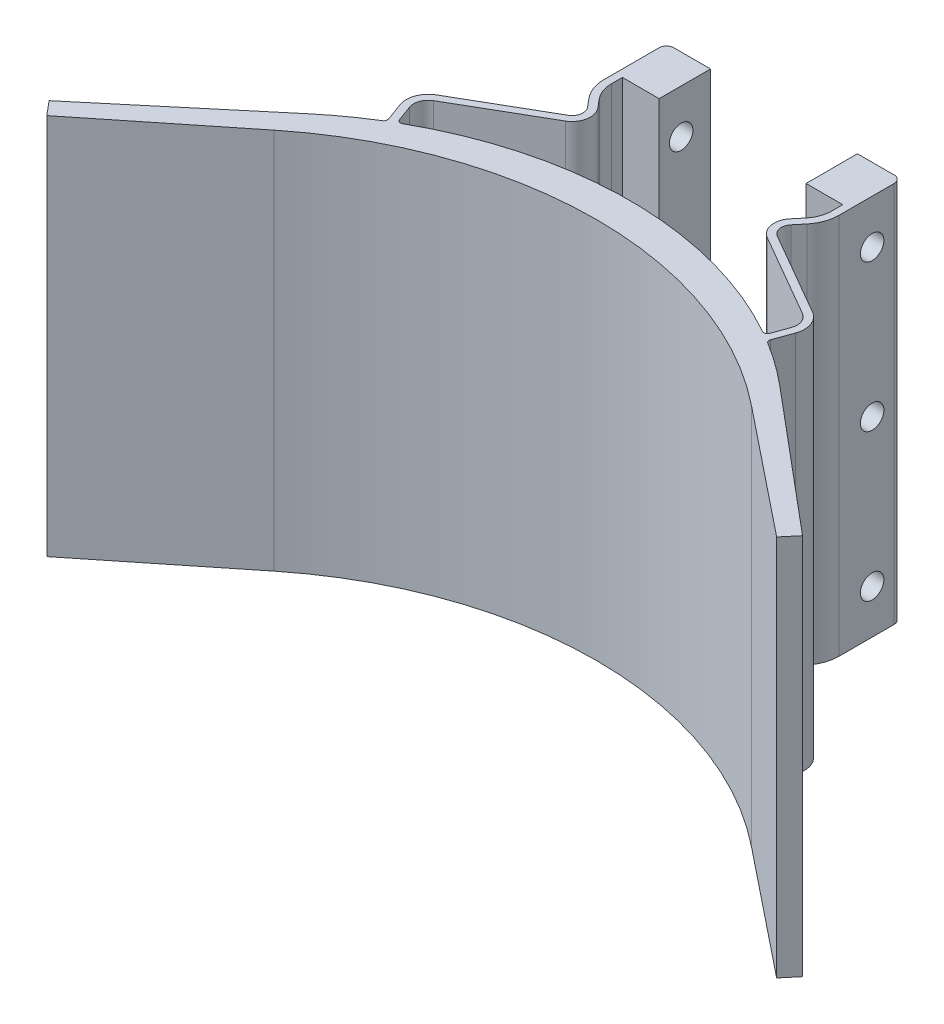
from build123d import *

# Parameters (mm, degrees)
EXTRUDE_1_DEPTH     = 52
SKETCH_2_R          = 1.6
CUT_EXTRUDE_1_DEPTH = 98.011718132
FILLET_2_R          = 1
FILLET_4_R          = 0.5


with BuildPart() as part:
    # Sketch 1 → Extrude 1 (new body)
    with BuildSketch(Plane(origin=(0, 0, 0), x_dir=(1, 0, 0), z_dir=(0, 1, 0))):
        with BuildLine():
            Line((-10, -3), (-15, -3))
            Line((-15, -3), (-15, -4.5))
            ThreePointArc((-15, -4.5), (-14.760209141, -5.868420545), (-14.069411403, -7.073772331))
            Line((-14.069411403, -7.073772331), (-13.078077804, -8.265444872))
            ThreePointArc((-13.078077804, -8.265444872), (-12.538908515, -10.303611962), (-13.75, -12.029325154))
            Line((-13.75, -12.029325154), (-25.10287208, -18.583908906))
            ThreePointArc((-25.10287208, -18.583908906), (-25.982257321, -19.631919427), (-25.982257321, -21))
            Line((-25.982257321, -21), (-25, -23.698729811))
            ThreePointArc((-25, -23.698729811), (0, -17), (25, -23.698729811))
            Line((25, -23.698729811), (25.982257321, -21))
            ThreePointArc((25.982257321, -21), (25.982257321, -19.631919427), (25.10287208, -18.583908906))
            Line((25.10287208, -18.583908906), (13.75, -12.029325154))
            ThreePointArc((13.75, -12.029325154), (12.538908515, -10.303611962), (13.078077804, -8.265444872))
            Line((13.078077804, -8.265444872), (14.069411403, -7.073772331))
            ThreePointArc((14.069411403, -7.073772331), (14.760209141, -5.868420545), (15, -4.5))
            Line((15, -4.5), (15, -3))
            Line((15, -3), (10, -3))
            Line((10, -3), (10, 4))
            Line((10, 4), (16, 4))
            Line((16, 4), (16, -4.5))
            ThreePointArc((16, -4.5), (15.700626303, -6.208443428), (14.838180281, -7.71329904))
            Line((14.838180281, -7.71329904), (13.846846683, -8.904971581))
            ThreePointArc((13.846846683, -8.904971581), (13.523345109, -10.127871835), (14.25, -11.163299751))
            Line((14.25, -11.163299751), (25.60287208, -17.717883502))
            ThreePointArc((25.60287208, -17.717883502), (26.921949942, -19.289899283), (26.921949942, -21.342020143))
            Line((26.921949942, -21.342020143), (25.875791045, -24.21631809))
            ThreePointArc((25.875791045, -24.21631809), (29.094001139, -26.33626803), (32.139380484, -28.697777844))
            Line((32.139380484, -28.697777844), (51.290491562, -44.767468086))
            Line((51.290491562, -44.767468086), (49.683522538, -46.682579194))
            Line((49.683522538, -46.682579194), (32.5, -32.924750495))
            ThreePointArc((32.5, -32.924750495), (0, -21.517237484), (-32.5, -32.924750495))
            Line((-32.5, -32.924750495), (-49.683522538, -46.682579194))
            Line((-49.683522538, -46.682579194), (-51.290491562, -44.767468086))
            Line((-51.290491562, -44.767468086), (-32.139380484, -28.697777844))
            ThreePointArc((-32.139380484, -28.697777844), (-29.094001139, -26.33626803), (-25.875791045, -24.21631809))
            Line((-25.875791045, -24.21631809), (-26.921949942, -21.342020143))
            ThreePointArc((-26.921949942, -21.342020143), (-26.921949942, -19.289899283), (-25.60287208, -17.717883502))
            Line((-25.60287208, -17.717883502), (-14.25, -11.163299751))
            ThreePointArc((-14.25, -11.163299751), (-13.523345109, -10.127871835), (-13.846846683, -8.904971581))
            Line((-13.846846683, -8.904971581), (-14.838180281, -7.71329904))
            ThreePointArc((-14.838180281, -7.71329904), (-15.700626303, -6.208443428), (-16, -4.5))
            Line((-16, -4.5), (-16, 4))
            Line((-16, 4), (-10, 4))
            Line((-10, 4), (-10, -3))
        make_face()
    extrude(amount=EXTRUDE_1_DEPTH)

    # Sketch 2 → Cut-Extrude 1 (cut, through all)
    with BuildSketch(Plane(origin=(16, 0, 0), x_dir=(0, 0, -1), z_dir=(1, 0, 0))):
        with Locations((0, 6)):
            Circle(SKETCH_2_R)
        with Locations((0, 26)):
            Circle(SKETCH_2_R)
        with Locations((0, 46)):
            Circle(SKETCH_2_R)
    extrude(amount=-CUT_EXTRUDE_1_DEPTH, mode=Mode.SUBTRACT)

    # Fillet 2
    fillet_2_edges = [part.edges().sort_by_distance(p)[0] for p in [
        (16, 26, -4),
        (-16, 26, -4),
    ]]
    fillet(fillet_2_edges, radius=FILLET_2_R)

    # Fillet 4
    fillet_4_edges = [part.edges().sort_by_distance(p)[0] for p in [
        (-25, 26, 23.698729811),
        (25, 26, 23.698729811),
        (25.875791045, 26, 24.21631809),
        (-25.875791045, 26, 24.21631809),
    ]]
    fillet(fillet_4_edges, radius=FILLET_4_R)


solid = part.part
